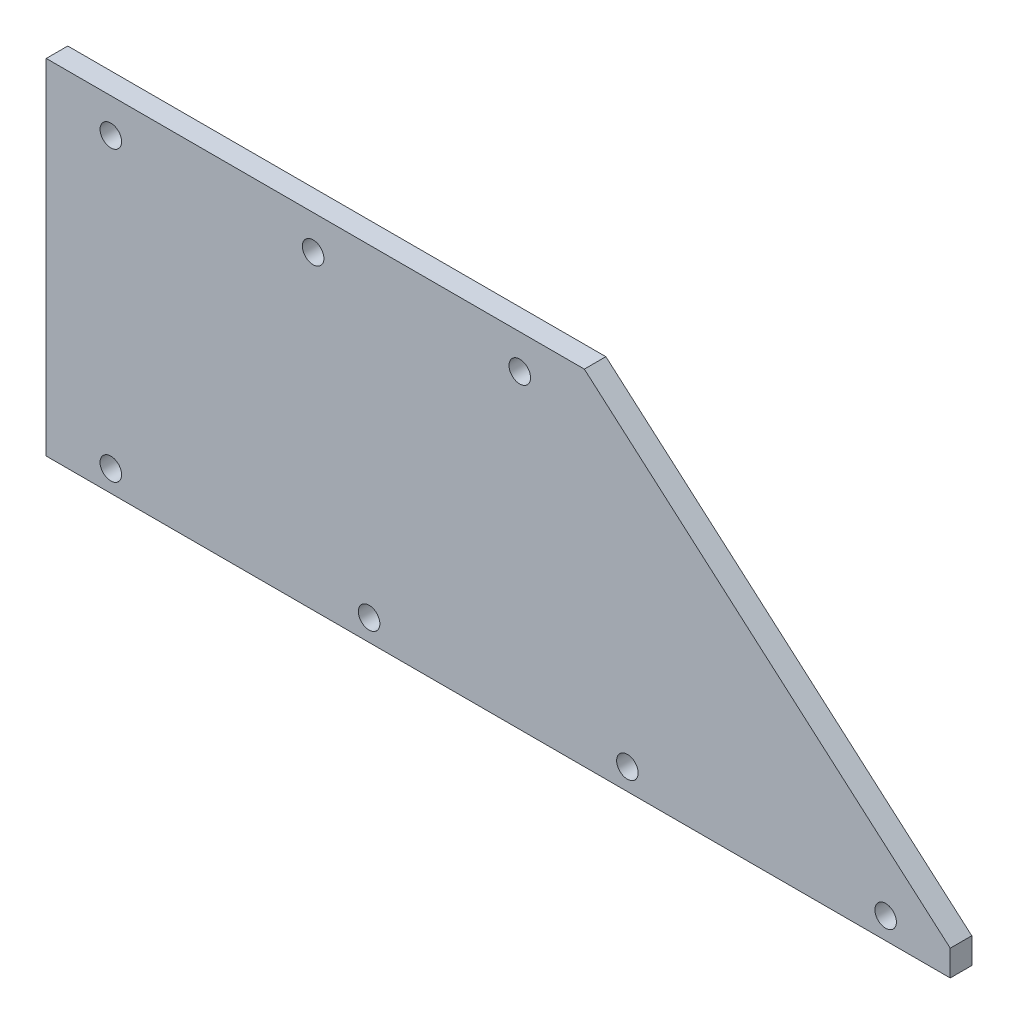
from build123d import *

# Parameters (mm, degrees)
SKETCH1_R           = 3.175
BOSS_EXTRUDE1_DEPTH = 3.175


with BuildPart() as part:
    # Sketch1 → Boss-Extrude1 (new, symmetric)
    with BuildSketch(Plane.XY):
        Polygon((0, 0), (266.7, 0), (266.7, 7.62), (158.75, 101.6), (0, 101.6), align=None)
        with Locations((19.05, 6.35)):
            Circle(SKETCH1_R, mode=Mode.SUBTRACT)
        with Locations((19.05, 91.44)):
            Circle(SKETCH1_R, mode=Mode.SUBTRACT)
        with Locations((78.74, 91.44)):
            Circle(SKETCH1_R, mode=Mode.SUBTRACT)
        with Locations((139.7, 91.44)):
            Circle(SKETCH1_R, mode=Mode.SUBTRACT)
        with Locations((95.25, 6.35)):
            Circle(SKETCH1_R, mode=Mode.SUBTRACT)
        with Locations((171.45, 6.35)):
            Circle(SKETCH1_R, mode=Mode.SUBTRACT)
        with Locations((247.65, 6.35)):
            Circle(SKETCH1_R, mode=Mode.SUBTRACT)
    extrude(amount=BOSS_EXTRUDE1_DEPTH, both=True)


solid = part.part
